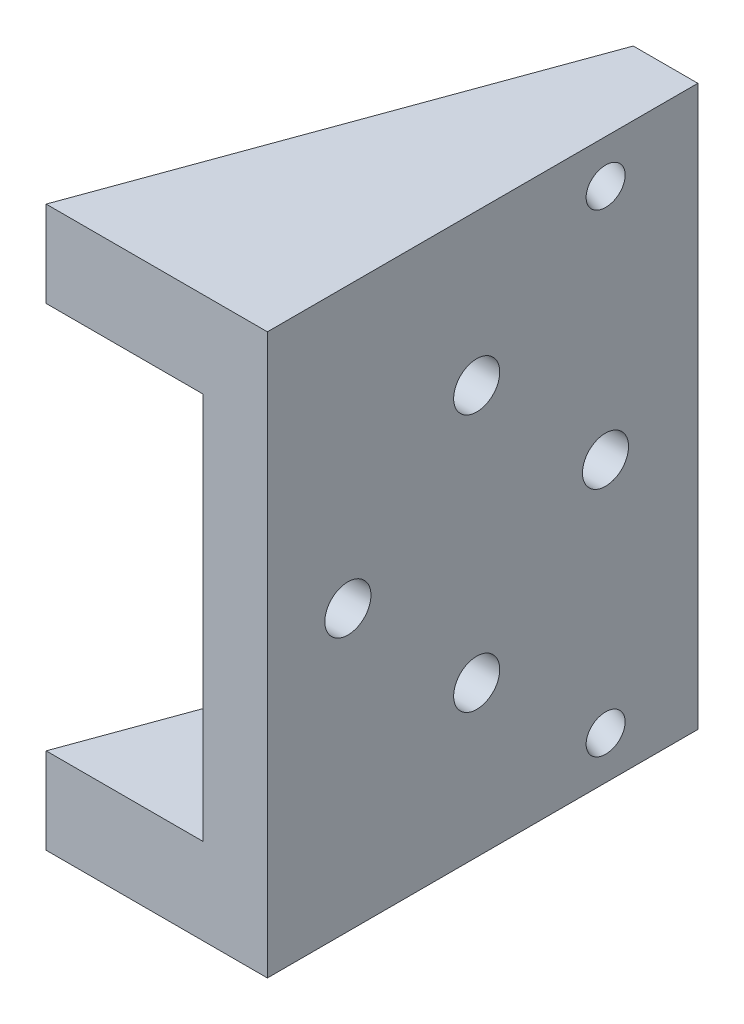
from build123d import *

# Parameters (mm, degrees)
BOSS_EXTRUDE1_DEPTH       = 20.6375
M3_CLEARANCE_HOLE1_D      = 3.4
CUT_EXTRUDE1_DEPTH        = 14.2875
CUT_EXTRUDE1_DEPTH_BACK   = 14.2875
F_6_32_TAPPED_HOLE1_D     = 2.7051
F_6_32_TAPPED_HOLE1_DEPTH = 8.382
F_6_32_TAPPED_HOLE1_TIP   = 0.81269403


with BuildPart() as part:
    # Sketch1 → Boss-Extrude1 (new, symmetric)
    with BuildSketch(Plane(origin=(0, 0, 0), x_dir=(1, 0, 0), z_dir=(0, 1, 0))):
        Polygon((0, 0), (-11.556054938, -31.75), (4.7625, -31.75), (4.7625, 0), align=None)
    extrude(amount=BOSS_EXTRUDE1_DEPTH, both=True)

    # M3 Clearance Hole1 (through all)
    with Locations(Plane(origin=(4.7625, 0, 0), x_dir=(0, 0, -1), z_dir=(1, 0, 0))):
        with Locations((-16.3125, 9.5), (-6.8125, 0), (-16.3125, -9.5), (-25.8125, 0)):
            Hole(M3_CLEARANCE_HOLE1_D / 2)

    # Sketch15 → Cut-Extrude1 (cut, two sides: drawn at the far end of the back side and taken through both)
    with BuildSketch(Plane(origin=(0, 0, 0), x_dir=(1, 0, 0), z_dir=(0, 1, 0)).offset(-CUT_EXTRUDE1_DEPTH_BACK)):
        Polygon((-11.556054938, -31.75), (0, 0), (0, -31.75), align=None)
    extrude(amount=CUT_EXTRUDE1_DEPTH + CUT_EXTRUDE1_DEPTH_BACK, mode=Mode.SUBTRACT)

    # 6-32 Tapped Hole1
    with Locations(Plane(origin=(0, 0, 0), x_dir=(-0.34202014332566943, 0, 0.9396926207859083), z_dir=(-0.9396926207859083, 0, -0.34202014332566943))):
        with Locations((4.7625, 17.4625), (26.9875, 17.4625), (26.9875, -17.4625), (4.7625, -17.4625)):
            Hole(F_6_32_TAPPED_HOLE1_D / 2, depth=F_6_32_TAPPED_HOLE1_DEPTH)
            with Locations((0, 0, -(F_6_32_TAPPED_HOLE1_DEPTH + F_6_32_TAPPED_HOLE1_TIP / 2))):  # 118° drill point
                Cone(0, F_6_32_TAPPED_HOLE1_D / 2, F_6_32_TAPPED_HOLE1_TIP, mode=Mode.SUBTRACT)


solid = part.part
